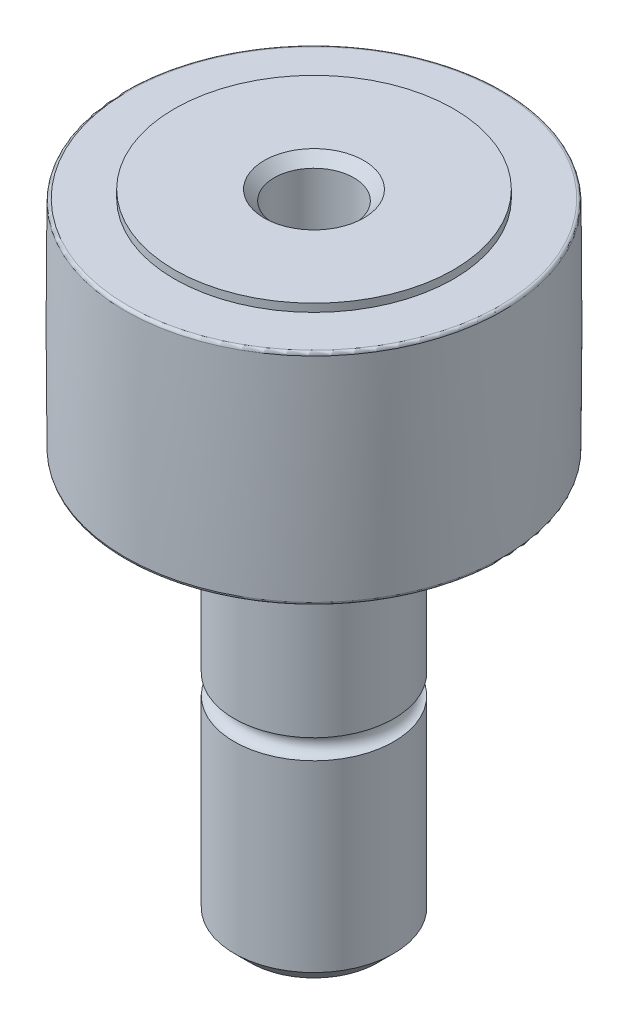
ISO-10303-21;
HEADER;
FILE_DESCRIPTION(('STEP AP214'),'2;1');
FILE_NAME('part.step','',(''),(''),'','','');
FILE_SCHEMA(('AUTOMOTIVE_DESIGN { 1 0 10303 214 1 1 1 1 }'));
ENDSEC;
DATA;
#1=APPLICATION_CONTEXT('core data for automotive mechanical design processes');
#2=APPLICATION_PROTOCOL_DEFINITION('international standard','automotive_design',2000,#1);
#3=PRODUCT_CONTEXT('',#1,'mechanical');
#4=PRODUCT('Part','Part','',(#3));
#5=PRODUCT_RELATED_PRODUCT_CATEGORY('part','',(#4));
#6=PRODUCT_DEFINITION_FORMATION('','',#4);
#7=PRODUCT_DEFINITION_CONTEXT('part definition',#1,'design');
#8=PRODUCT_DEFINITION('design','',#6,#7);
#9=PRODUCT_DEFINITION_SHAPE('','',#8);
#10=(LENGTH_UNIT() NAMED_UNIT(*) SI_UNIT(.MILLI.,.METRE.));
#11=(NAMED_UNIT(*) PLANE_ANGLE_UNIT() SI_UNIT($,.RADIAN.));
#12=(NAMED_UNIT(*) SI_UNIT($,.STERADIAN.) SOLID_ANGLE_UNIT());
#13=UNCERTAINTY_MEASURE_WITH_UNIT(LENGTH_MEASURE(1.E-05),#10,'distance_accuracy_value','');
#14=(GEOMETRIC_REPRESENTATION_CONTEXT(3) GLOBAL_UNCERTAINTY_ASSIGNED_CONTEXT((#13)) GLOBAL_UNIT_ASSIGNED_CONTEXT((#10,
#11,#12)) REPRESENTATION_CONTEXT('',''));
#15=CARTESIAN_POINT('',(0.,0.,0.));
#16=DIRECTION('',(0.,0.,1.));
#17=DIRECTION('',(1.,0.,0.));
#18=AXIS2_PLACEMENT_3D('',#15,#16,#17);
#19=CARTESIAN_POINT('',(0.,0.,0.));
#20=DIRECTION('',(0.,-1.,0.));
#21=DIRECTION('',(0.,0.,-1.));
#22=AXIS2_PLACEMENT_3D('',#19,#20,#21);
#23=PLANE('',#22);
#24=CARTESIAN_POINT('',(0.,0.,0.));
#25=DIRECTION('',(0.,-1.,0.));
#26=DIRECTION('',(0.,0.,-1.));
#27=AXIS2_PLACEMENT_3D('',#24,#25,#26);
#28=CIRCLE('',#27,3.19999999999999);
#29=CARTESIAN_POINT('',(0.,0.,-3.19999999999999));
#30=VERTEX_POINT('',#29);
#31=EDGE_CURVE('E87',#30,#30,#28,.T.);
#32=ORIENTED_EDGE('',*,*,#31,.T.);
#33=EDGE_LOOP('',(#32));
#34=FACE_BOUND('',#33,.T.);
#35=ADVANCED_FACE('F40',(#34),#23,.T.);
#36=CARTESIAN_POINT('',(0.,-6.89025893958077,0.));
#37=DIRECTION('',(0.,-1.,0.));
#38=DIRECTION('',(0.,0.,-1.));
#39=AXIS2_PLACEMENT_3D('',#36,#37,#38);
#40=CYLINDRICAL_SURFACE('',#39,4.);
#41=CARTESIAN_POINT('',(0.,0.800000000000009,0.));
#42=DIRECTION('',(0.,-1.,0.));
#43=DIRECTION('',(0.,0.,-1.));
#44=AXIS2_PLACEMENT_3D('',#41,#42,#43);
#45=CIRCLE('',#44,4.);
#46=CARTESIAN_POINT('',(0.,0.800000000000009,-4.));
#47=VERTEX_POINT('',#46);
#48=EDGE_CURVE('E91',#47,#47,#45,.F.);
#49=ORIENTED_EDGE('',*,*,#48,.T.);
#50=EDGE_LOOP('',(#49));
#51=FACE_BOUND('',#50,.T.);
#52=CARTESIAN_POINT('',(0.,9.99999999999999,0.));
#53=DIRECTION('',(0.,-1.,0.));
#54=DIRECTION('',(0.,0.,-1.));
#55=AXIS2_PLACEMENT_3D('',#52,#53,#54);
#56=CIRCLE('',#55,4.);
#57=CARTESIAN_POINT('',(0.,9.99999999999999,-4.));
#58=VERTEX_POINT('',#57);
#59=EDGE_CURVE('E84',#58,#58,#56,.T.);
#60=ORIENTED_EDGE('',*,*,#59,.T.);
#61=EDGE_LOOP('',(#60));
#62=FACE_BOUND('',#61,.T.);
#63=ADVANCED_FACE('F124',(#51,#62),#40,.T.);
#64=CARTESIAN_POINT('',(0.,10.5,0.));
#65=DIRECTION('',(0.,-1.,0.));
#66=DIRECTION('',(0.,0.,-1.));
#67=AXIS2_PLACEMENT_3D('',#64,#65,#66);
#68=TOROIDAL_SURFACE('',#67,4.,0.5);
#69=CARTESIAN_POINT('',(0.,11.,0.));
#70=DIRECTION('',(0.,-1.,0.));
#71=DIRECTION('',(0.,0.,-1.));
#72=AXIS2_PLACEMENT_3D('',#69,#70,#71);
#73=CIRCLE('',#72,4.);
#74=CARTESIAN_POINT('',(0.,11.,-4.));
#75=VERTEX_POINT('',#74);
#76=EDGE_CURVE('E81',#75,#75,#73,.T.);
#77=ORIENTED_EDGE('',*,*,#76,.T.);
#78=EDGE_LOOP('',(#77));
#79=FACE_BOUND('',#78,.T.);
#80=ORIENTED_EDGE('',*,*,#59,.F.);
#81=EDGE_LOOP('',(#80));
#82=FACE_BOUND('',#81,.T.);
#83=ADVANCED_FACE('F129',(#79,#82),#68,.F.);
#84=CARTESIAN_POINT('',(0.,-6.89025893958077,0.));
#85=DIRECTION('',(0.,-1.,0.));
#86=DIRECTION('',(0.,0.,-1.));
#87=AXIS2_PLACEMENT_3D('',#84,#85,#86);
#88=CYLINDRICAL_SURFACE('',#87,4.);
#89=CARTESIAN_POINT('',(0.,20.,0.));
#90=DIRECTION('',(0.,-1.,0.));
#91=DIRECTION('',(0.,0.,-1.));
#92=AXIS2_PLACEMENT_3D('',#89,#90,#91);
#93=CIRCLE('',#92,4.);
#94=CARTESIAN_POINT('',(0.,20.,-4.));
#95=VERTEX_POINT('',#94);
#96=EDGE_CURVE('E78',#95,#95,#93,.T.);
#97=ORIENTED_EDGE('',*,*,#96,.T.);
#98=EDGE_LOOP('',(#97));
#99=FACE_BOUND('',#98,.T.);
#100=ORIENTED_EDGE('',*,*,#76,.F.);
#101=EDGE_LOOP('',(#100));
#102=FACE_BOUND('',#101,.T.);
#103=ADVANCED_FACE('F173',(#99,#102),#88,.T.);
#104=CARTESIAN_POINT('',(4.,20.,0.));
#105=DIRECTION('',(0.,-1.,0.));
#106=DIRECTION('',(0.,0.,-1.));
#107=AXIS2_PLACEMENT_3D('',#104,#105,#106);
#108=PLANE('',#107);
#109=CARTESIAN_POINT('',(0.,20.,0.));
#110=DIRECTION('',(0.,-1.,0.));
#111=DIRECTION('',(0.,0.,-1.));
#112=AXIS2_PLACEMENT_3D('',#109,#110,#111);
#113=CIRCLE('',#112,7.00000000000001);
#114=CARTESIAN_POINT('',(0.,20.,-7.00000000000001));
#115=VERTEX_POINT('',#114);
#116=EDGE_CURVE('E75',#115,#115,#113,.T.);
#117=ORIENTED_EDGE('',*,*,#116,.T.);
#118=EDGE_LOOP('',(#117));
#119=FACE_BOUND('',#118,.T.);
#120=ORIENTED_EDGE('',*,*,#96,.F.);
#121=EDGE_LOOP('',(#120));
#122=FACE_BOUND('',#121,.T.);
#123=ADVANCED_FACE('F169',(#119,#122),#108,.T.);
#124=CARTESIAN_POINT('',(0.,-6.89025893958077,0.));
#125=DIRECTION('',(0.,-1.,0.));
#126=DIRECTION('',(0.,0.,-1.));
#127=AXIS2_PLACEMENT_3D('',#124,#125,#126);
#128=CYLINDRICAL_SURFACE('',#127,7.00000000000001);
#129=CARTESIAN_POINT('',(0.,20.6,0.));
#130=DIRECTION('',(0.,-1.,0.));
#131=DIRECTION('',(0.,0.,-1.));
#132=AXIS2_PLACEMENT_3D('',#129,#130,#131);
#133=CIRCLE('',#132,7.00000000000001);
#134=CARTESIAN_POINT('',(0.,20.6,-7.00000000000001));
#135=VERTEX_POINT('',#134);
#136=EDGE_CURVE('E72',#135,#135,#133,.T.);
#137=ORIENTED_EDGE('',*,*,#136,.T.);
#138=EDGE_LOOP('',(#137));
#139=FACE_BOUND('',#138,.T.);
#140=ORIENTED_EDGE('',*,*,#116,.F.);
#141=EDGE_LOOP('',(#140));
#142=FACE_BOUND('',#141,.T.);
#143=ADVANCED_FACE('F165',(#139,#142),#128,.T.);
#144=CARTESIAN_POINT('',(7.00000000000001,20.6,0.));
#145=DIRECTION('',(0.,-1.,0.));
#146=DIRECTION('',(0.,0.,-1.));
#147=AXIS2_PLACEMENT_3D('',#144,#145,#146);
#148=PLANE('',#147);
#149=CARTESIAN_POINT('',(0.,20.6,0.));
#150=DIRECTION('',(0.,-1.,0.));
#151=DIRECTION('',(0.,0.,-1.));
#152=AXIS2_PLACEMENT_3D('',#149,#150,#151);
#153=CIRCLE('',#152,9.32136809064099);
#154=CARTESIAN_POINT('',(0.,20.6,-9.32136809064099));
#155=VERTEX_POINT('',#154);
#156=EDGE_CURVE('E104',#155,#155,#153,.T.);
#157=ORIENTED_EDGE('',*,*,#156,.T.);
#158=EDGE_LOOP('',(#157));
#159=FACE_BOUND('',#158,.T.);
#160=ORIENTED_EDGE('',*,*,#136,.F.);
#161=EDGE_LOOP('',(#160));
#162=FACE_BOUND('',#161,.T.);
#163=ADVANCED_FACE('F161',(#159,#162),#148,.T.);
#164=CARTESIAN_POINT('',(0.,26.1,0.));
#165=DIRECTION('',(0.,-1.,0.));
#166=DIRECTION('',(0.,0.,-1.));
#167=AXIS2_PLACEMENT_3D('',#164,#165,#166);
#168=DEGENERATE_TOROIDAL_SURFACE('',#167,490.5,500.,.F.);
#169=CARTESIAN_POINT('',(0.,31.451605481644,0.));
#170=DIRECTION('',(0.,-1.,0.));
#171=DIRECTION('',(0.,0.,-1.));
#172=AXIS2_PLACEMENT_3D('',#169,#170,#171);
#173=CIRCLE('',#172,9.47135949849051);
#174=CARTESIAN_POINT('',(0.,31.451605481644,-9.47135949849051));
#175=VERTEX_POINT('',#174);
#176=EDGE_CURVE('E98',#175,#175,#173,.T.);
#177=ORIENTED_EDGE('',*,*,#176,.T.);
#178=EDGE_LOOP('',(#177));
#179=FACE_BOUND('',#178,.T.);
#180=CARTESIAN_POINT('',(0.,20.7483945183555,0.));
#181=DIRECTION('',(0.,1.,0.));
#182=DIRECTION('',(0.,0.,1.));
#183=AXIS2_PLACEMENT_3D('',#180,#181,#182);
#184=CIRCLE('',#183,9.47135949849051);
#185=CARTESIAN_POINT('',(0.,20.7483945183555,9.47135949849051));
#186=VERTEX_POINT('',#185);
#187=EDGE_CURVE('E94',#186,#186,#184,.T.);
#188=ORIENTED_EDGE('',*,*,#187,.T.);
#189=EDGE_LOOP('',(#188));
#190=FACE_BOUND('',#189,.T.);
#191=ADVANCED_FACE('F157',(#179,#190),#168,.F.);
#192=CARTESIAN_POINT('',(9.46974908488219,31.5999999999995,0.));
#193=DIRECTION('',(0.,1.,0.));
#194=DIRECTION('',(0.,0.,1.));
#195=AXIS2_PLACEMENT_3D('',#192,#193,#194);
#196=PLANE('',#195);
#197=CARTESIAN_POINT('',(0.,31.5999999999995,0.));
#198=DIRECTION('',(0.,1.,0.));
#199=DIRECTION('',(0.,0.,1.));
#200=AXIS2_PLACEMENT_3D('',#197,#198,#199);
#201=CIRCLE('',#200,9.32136809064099);
#202=CARTESIAN_POINT('',(0.,31.5999999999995,9.32136809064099));
#203=VERTEX_POINT('',#202);
#204=EDGE_CURVE('E101',#203,#203,#201,.T.);
#205=ORIENTED_EDGE('',*,*,#204,.T.);
#206=EDGE_LOOP('',(#205));
#207=FACE_BOUND('',#206,.T.);
#208=CARTESIAN_POINT('',(0.,31.6,0.));
#209=DIRECTION('',(0.,-1.,0.));
#210=DIRECTION('',(0.,0.,-1.));
#211=AXIS2_PLACEMENT_3D('',#208,#209,#210);
#212=CIRCLE('',#211,7.00000000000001);
#213=CARTESIAN_POINT('',(0.,31.6,-7.00000000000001));
#214=VERTEX_POINT('',#213);
#215=EDGE_CURVE('E63',#214,#214,#212,.T.);
#216=ORIENTED_EDGE('',*,*,#215,.T.);
#217=EDGE_LOOP('',(#216));
#218=FACE_BOUND('',#217,.T.);
#219=ADVANCED_FACE('F153',(#207,#218),#196,.T.);
#220=CARTESIAN_POINT('',(0.,-6.89025893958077,0.));
#221=DIRECTION('',(0.,-1.,0.));
#222=DIRECTION('',(0.,0.,-1.));
#223=AXIS2_PLACEMENT_3D('',#220,#221,#222);
#224=CYLINDRICAL_SURFACE('',#223,7.00000000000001);
#225=CARTESIAN_POINT('',(0.,32.,0.));
#226=DIRECTION('',(0.,-1.,0.));
#227=DIRECTION('',(0.,0.,-1.));
#228=AXIS2_PLACEMENT_3D('',#225,#226,#227);
#229=CIRCLE('',#228,7.00000000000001);
#230=CARTESIAN_POINT('',(0.,32.,-7.00000000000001));
#231=VERTEX_POINT('',#230);
#232=EDGE_CURVE('E59',#231,#231,#229,.T.);
#233=ORIENTED_EDGE('',*,*,#232,.T.);
#234=EDGE_LOOP('',(#233));
#235=FACE_BOUND('',#234,.T.);
#236=ORIENTED_EDGE('',*,*,#215,.F.);
#237=EDGE_LOOP('',(#236));
#238=FACE_BOUND('',#237,.T.);
#239=ADVANCED_FACE('F145',(#235,#238),#224,.T.);
#240=CARTESIAN_POINT('',(7.00000000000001,32.,0.));
#241=DIRECTION('',(0.,1.,0.));
#242=DIRECTION('',(0.,0.,1.));
#243=AXIS2_PLACEMENT_3D('',#240,#241,#242);
#244=PLANE('',#243);
#245=CARTESIAN_POINT('',(0.,32.,0.));
#246=DIRECTION('',(0.,1.,0.));
#247=DIRECTION('',(0.,0.,1.));
#248=AXIS2_PLACEMENT_3D('',#245,#246,#247);
#249=CIRCLE('',#248,2.5);
#250=CARTESIAN_POINT('',(0.,32.,2.5));
#251=VERTEX_POINT('',#250);
#252=EDGE_CURVE('E11',#251,#251,#249,.F.);
#253=ORIENTED_EDGE('',*,*,#252,.T.);
#254=EDGE_LOOP('',(#253));
#255=FACE_BOUND('',#254,.T.);
#256=ORIENTED_EDGE('',*,*,#232,.F.);
#257=EDGE_LOOP('',(#256));
#258=FACE_BOUND('',#257,.T.);
#259=ADVANCED_FACE('F136',(#255,#258),#244,.T.);
#260=CARTESIAN_POINT('',(0.,0.,0.));
#261=DIRECTION('',(0.,1.,0.));
#262=DIRECTION('',(0.,0.,1.));
#263=AXIS2_PLACEMENT_3D('',#260,#261,#262);
#264=CONICAL_SURFACE('',#263,3.19999999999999,0.785398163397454);
#265=ORIENTED_EDGE('',*,*,#48,.F.);
#266=EDGE_LOOP('',(#265));
#267=FACE_BOUND('',#266,.T.);
#268=ORIENTED_EDGE('',*,*,#31,.F.);
#269=EDGE_LOOP('',(#268));
#270=FACE_BOUND('',#269,.T.);
#271=ADVANCED_FACE('F133',(#267,#270),#264,.T.);
#272=CARTESIAN_POINT('',(0.,26.,0.));
#273=DIRECTION('',(0.,1.,0.));
#274=DIRECTION('',(0.,0.,1.));
#275=AXIS2_PLACEMENT_3D('',#272,#273,#274);
#276=CONICAL_SURFACE('',#275,2.,1.0471975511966);
#277=CARTESIAN_POINT('',(0.,26.,0.));
#278=DIRECTION('',(0.,1.,0.));
#279=DIRECTION('',(0.,0.,1.));
#280=AXIS2_PLACEMENT_3D('',#277,#278,#279);
#281=CIRCLE('',#280,2.);
#282=CARTESIAN_POINT('',(0.,26.,2.));
#283=VERTEX_POINT('',#282);
#284=EDGE_CURVE('E66',#283,#283,#281,.T.);
#285=ORIENTED_EDGE('',*,*,#284,.T.);
#286=EDGE_LOOP('',(#285));
#287=FACE_BOUND('',#286,.T.);
#288=CARTESIAN_POINT('',(0.,25.7113248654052,0.));
#289=DIRECTION('',(0.,1.,0.));
#290=DIRECTION('',(0.,0.,1.));
#291=AXIS2_PLACEMENT_3D('',#288,#289,#290);
#292=CIRCLE('',#291,1.5);
#293=CARTESIAN_POINT('',(0.,25.7113248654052,1.5));
#294=VERTEX_POINT('',#293);
#295=EDGE_CURVE('E60',#294,#294,#292,.T.);
#296=ORIENTED_EDGE('',*,*,#295,.F.);
#297=EDGE_LOOP('',(#296));
#298=FACE_BOUND('',#297,.T.);
#299=ADVANCED_FACE('F135',(#287,#298),#276,.F.);
#300=CARTESIAN_POINT('',(0.,32.,0.));
#301=DIRECTION('',(0.,1.,0.));
#302=DIRECTION('',(0.,0.,1.));
#303=AXIS2_PLACEMENT_3D('',#300,#301,#302);
#304=CYLINDRICAL_SURFACE('',#303,2.);
#305=CARTESIAN_POINT('',(0.,31.5,0.));
#306=DIRECTION('',(0.,1.,0.));
#307=DIRECTION('',(0.,0.,1.));
#308=AXIS2_PLACEMENT_3D('',#305,#306,#307);
#309=CIRCLE('',#308,2.);
#310=CARTESIAN_POINT('',(0.,31.5,2.));
#311=VERTEX_POINT('',#310);
#312=EDGE_CURVE('E46',#311,#311,#309,.T.);
#313=ORIENTED_EDGE('',*,*,#312,.T.);
#314=EDGE_LOOP('',(#313));
#315=FACE_BOUND('',#314,.T.);
#316=ORIENTED_EDGE('',*,*,#284,.F.);
#317=EDGE_LOOP('',(#316));
#318=FACE_BOUND('',#317,.T.);
#319=ADVANCED_FACE('F53',(#315,#318),#304,.F.);
#320=CARTESIAN_POINT('',(0.,22.,0.));
#321=DIRECTION('',(0.,1.,0.));
#322=DIRECTION('',(0.,0.,1.));
#323=AXIS2_PLACEMENT_3D('',#320,#321,#322);
#324=CONICAL_SURFACE('',#323,1.5,1.0471975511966);
#325=CARTESIAN_POINT('',(0.,21.1339745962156,0.));
#326=VERTEX_POINT('',#325);
#327=VERTEX_LOOP('',#326);
#328=FACE_BOUND('',#327,.T.);
#329=CARTESIAN_POINT('',(0.,22.,0.));
#330=DIRECTION('',(0.,1.,0.));
#331=DIRECTION('',(0.,0.,1.));
#332=AXIS2_PLACEMENT_3D('',#329,#330,#331);
#333=CIRCLE('',#332,1.5);
#334=CARTESIAN_POINT('',(0.,22.,1.5));
#335=VERTEX_POINT('',#334);
#336=EDGE_CURVE('E57',#335,#335,#333,.T.);
#337=ORIENTED_EDGE('',*,*,#336,.T.);
#338=EDGE_LOOP('',(#337));
#339=FACE_BOUND('',#338,.T.);
#340=ADVANCED_FACE('F49',(#328,#339),#324,.F.);
#341=CARTESIAN_POINT('',(0.,32.,0.));
#342=DIRECTION('',(0.,1.,0.));
#343=DIRECTION('',(0.,0.,1.));
#344=AXIS2_PLACEMENT_3D('',#341,#342,#343);
#345=CYLINDRICAL_SURFACE('',#344,1.5);
#346=ORIENTED_EDGE('',*,*,#295,.T.);
#347=EDGE_LOOP('',(#346));
#348=FACE_BOUND('',#347,.T.);
#349=ORIENTED_EDGE('',*,*,#336,.F.);
#350=EDGE_LOOP('',(#349));
#351=FACE_BOUND('',#350,.T.);
#352=ADVANCED_FACE('F52',(#348,#351),#345,.F.);
#353=CARTESIAN_POINT('',(0.,31.4499999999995,0.));
#354=DIRECTION('',(0.,1.,0.));
#355=DIRECTION('',(0.,0.,1.));
#356=AXIS2_PLACEMENT_3D('',#353,#354,#355);
#357=TOROIDAL_SURFACE('',#356,9.32136809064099,0.15);
#358=ORIENTED_EDGE('',*,*,#204,.F.);
#359=EDGE_LOOP('',(#358));
#360=FACE_BOUND('',#359,.T.);
#361=ORIENTED_EDGE('',*,*,#176,.F.);
#362=EDGE_LOOP('',(#361));
#363=FACE_BOUND('',#362,.T.);
#364=ADVANCED_FACE('F119',(#360,#363),#357,.T.);
#365=CARTESIAN_POINT('',(0.,20.75,0.));
#366=DIRECTION('',(0.,-1.,0.));
#367=DIRECTION('',(0.,0.,-1.));
#368=AXIS2_PLACEMENT_3D('',#365,#366,#367);
#369=TOROIDAL_SURFACE('',#368,9.32136809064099,0.15);
#370=ORIENTED_EDGE('',*,*,#187,.F.);
#371=EDGE_LOOP('',(#370));
#372=FACE_BOUND('',#371,.T.);
#373=ORIENTED_EDGE('',*,*,#156,.F.);
#374=EDGE_LOOP('',(#373));
#375=FACE_BOUND('',#374,.T.);
#376=ADVANCED_FACE('F113',(#372,#375),#369,.T.);
#377=CARTESIAN_POINT('',(0.,31.5,0.));
#378=DIRECTION('',(0.,1.,0.));
#379=DIRECTION('',(0.,0.,1.));
#380=AXIS2_PLACEMENT_3D('',#377,#378,#379);
#381=CONICAL_SURFACE('',#380,2.,0.785398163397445);
#382=ORIENTED_EDGE('',*,*,#252,.F.);
#383=EDGE_LOOP('',(#382));
#384=FACE_BOUND('',#383,.T.);
#385=ORIENTED_EDGE('',*,*,#312,.F.);
#386=EDGE_LOOP('',(#385));
#387=FACE_BOUND('',#386,.T.);
#388=ADVANCED_FACE('F111',(#384,#387),#381,.F.);
#389=CLOSED_SHELL('',(#35,#63,#83,#103,#123,#143,#163,#191,#219,#239,#259,#271,#299,#319,#340,
#352,#364,#376,#388));
#390=MANIFOLD_SOLID_BREP('B2',#389);
#391=ADVANCED_BREP_SHAPE_REPRESENTATION('',(#18,#390),#14);
#392=SHAPE_DEFINITION_REPRESENTATION(#9,#391);
ENDSEC;
END-ISO-10303-21;
